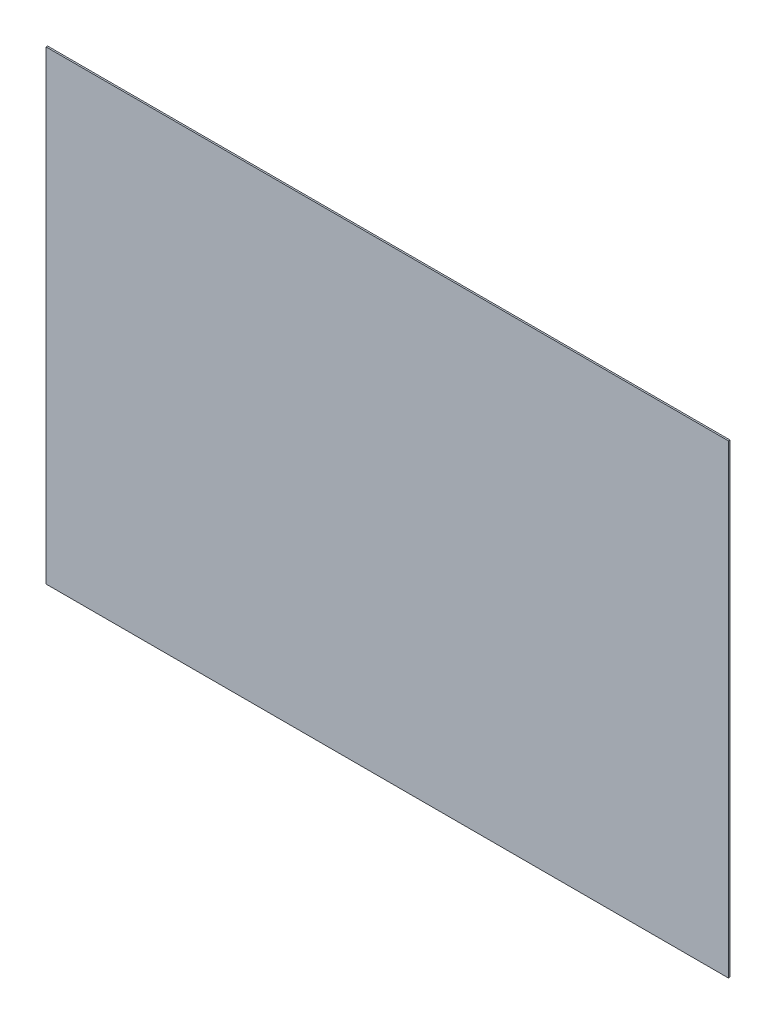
ISO-10303-21;
HEADER;
FILE_DESCRIPTION(('STEP AP214'),'2;1');
FILE_NAME('part.step','',(''),(''),'','','');
FILE_SCHEMA(('AUTOMOTIVE_DESIGN { 1 0 10303 214 1 1 1 1 }'));
ENDSEC;
DATA;
#1=APPLICATION_CONTEXT('core data for automotive mechanical design processes');
#2=APPLICATION_PROTOCOL_DEFINITION('international standard','automotive_design',2000,#1);
#3=PRODUCT_CONTEXT('',#1,'mechanical');
#4=PRODUCT('Part','Part','',(#3));
#5=PRODUCT_RELATED_PRODUCT_CATEGORY('part','',(#4));
#6=PRODUCT_DEFINITION_FORMATION('','',#4);
#7=PRODUCT_DEFINITION_CONTEXT('part definition',#1,'design');
#8=PRODUCT_DEFINITION('design','',#6,#7);
#9=PRODUCT_DEFINITION_SHAPE('','',#8);
#10=(LENGTH_UNIT() NAMED_UNIT(*) SI_UNIT(.MILLI.,.METRE.));
#11=(NAMED_UNIT(*) PLANE_ANGLE_UNIT() SI_UNIT($,.RADIAN.));
#12=(NAMED_UNIT(*) SI_UNIT($,.STERADIAN.) SOLID_ANGLE_UNIT());
#13=UNCERTAINTY_MEASURE_WITH_UNIT(LENGTH_MEASURE(1.E-05),#10,'distance_accuracy_value','');
#14=(GEOMETRIC_REPRESENTATION_CONTEXT(3) GLOBAL_UNCERTAINTY_ASSIGNED_CONTEXT((#13)) GLOBAL_UNIT_ASSIGNED_CONTEXT((#10,
#11,#12)) REPRESENTATION_CONTEXT('',''));
#15=CARTESIAN_POINT('',(0.,0.,0.));
#16=DIRECTION('',(0.,0.,1.));
#17=DIRECTION('',(1.,0.,0.));
#18=AXIS2_PLACEMENT_3D('',#15,#16,#17);
#19=CARTESIAN_POINT('',(-1100.,750.,5.));
#20=DIRECTION('',(1.,0.,0.));
#21=DIRECTION('',(0.,0.,-1.));
#22=AXIS2_PLACEMENT_3D('',#19,#20,#21);
#23=PLANE('',#22);
#24=DIRECTION('',(0.,-1.,0.));
#25=VECTOR('',#24,1.);
#26=CARTESIAN_POINT('',(-1100.,750.,0.));
#27=LINE('',#26,#25);
#28=CARTESIAN_POINT('',(-1100.,750.,0.));
#29=VERTEX_POINT('',#28);
#30=CARTESIAN_POINT('',(-1100.,-750.,0.));
#31=VERTEX_POINT('',#30);
#32=EDGE_CURVE('E72',#29,#31,#27,.T.);
#33=ORIENTED_EDGE('',*,*,#32,.T.);
#34=DIRECTION('',(0.,0.,-1.));
#35=VECTOR('',#34,1.);
#36=CARTESIAN_POINT('',(-1100.,-750.,5.));
#37=LINE('',#36,#35);
#38=CARTESIAN_POINT('',(-1100.,-750.,5.));
#39=VERTEX_POINT('',#38);
#40=EDGE_CURVE('E11',#39,#31,#37,.T.);
#41=ORIENTED_EDGE('',*,*,#40,.F.);
#42=DIRECTION('',(0.,-1.,0.));
#43=VECTOR('',#42,1.);
#44=CARTESIAN_POINT('',(-1100.,750.,5.));
#45=LINE('',#44,#43);
#46=CARTESIAN_POINT('',(-1100.,750.,5.));
#47=VERTEX_POINT('',#46);
#48=EDGE_CURVE('E90',#47,#39,#45,.T.);
#49=ORIENTED_EDGE('',*,*,#48,.F.);
#50=DIRECTION('',(0.,0.,-1.));
#51=VECTOR('',#50,1.);
#52=CARTESIAN_POINT('',(-1100.,750.,5.));
#53=LINE('',#52,#51);
#54=EDGE_CURVE('E84',#47,#29,#53,.T.);
#55=ORIENTED_EDGE('',*,*,#54,.T.);
#56=EDGE_LOOP('',(#33,#41,#49,#55));
#57=FACE_BOUND('',#56,.T.);
#58=ADVANCED_FACE('F28',(#57),#23,.F.);
#59=CARTESIAN_POINT('',(-1100.,-750.,5.));
#60=DIRECTION('',(0.,1.,0.));
#61=DIRECTION('',(-1.,0.,0.));
#62=AXIS2_PLACEMENT_3D('',#59,#60,#61);
#63=PLANE('',#62);
#64=DIRECTION('',(1.,0.,0.));
#65=VECTOR('',#64,1.);
#66=CARTESIAN_POINT('',(-1100.,-750.,0.));
#67=LINE('',#66,#65);
#68=CARTESIAN_POINT('',(1100.,-750.000000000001,0.));
#69=VERTEX_POINT('',#68);
#70=EDGE_CURVE('E68',#31,#69,#67,.T.);
#71=ORIENTED_EDGE('',*,*,#70,.T.);
#72=DIRECTION('',(0.,0.,-1.));
#73=VECTOR('',#72,1.);
#74=CARTESIAN_POINT('',(1100.,-750.000000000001,5.));
#75=LINE('',#74,#73);
#76=CARTESIAN_POINT('',(1100.,-750.000000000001,5.));
#77=VERTEX_POINT('',#76);
#78=EDGE_CURVE('E35',#77,#69,#75,.T.);
#79=ORIENTED_EDGE('',*,*,#78,.F.);
#80=DIRECTION('',(1.,0.,0.));
#81=VECTOR('',#80,1.);
#82=CARTESIAN_POINT('',(-1100.,-750.,5.));
#83=LINE('',#82,#81);
#84=EDGE_CURVE('E80',#39,#77,#83,.T.);
#85=ORIENTED_EDGE('',*,*,#84,.F.);
#86=ORIENTED_EDGE('',*,*,#40,.T.);
#87=EDGE_LOOP('',(#71,#79,#85,#86));
#88=FACE_BOUND('',#87,.T.);
#89=ADVANCED_FACE('F79',(#88),#63,.F.);
#90=CARTESIAN_POINT('',(1100.,750.000000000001,5.));
#91=DIRECTION('',(-1.,0.,0.));
#92=DIRECTION('',(0.,0.,1.));
#93=AXIS2_PLACEMENT_3D('',#90,#91,#92);
#94=PLANE('',#93);
#95=DIRECTION('',(0.,1.,0.));
#96=VECTOR('',#95,1.);
#97=CARTESIAN_POINT('',(1100.,750.000000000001,0.));
#98=LINE('',#97,#96);
#99=CARTESIAN_POINT('',(1100.,750.000000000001,0.));
#100=VERTEX_POINT('',#99);
#101=EDGE_CURVE('E73',#69,#100,#98,.T.);
#102=ORIENTED_EDGE('',*,*,#101,.T.);
#103=DIRECTION('',(0.,0.,-1.));
#104=VECTOR('',#103,1.);
#105=CARTESIAN_POINT('',(1100.,750.000000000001,5.));
#106=LINE('',#105,#104);
#107=CARTESIAN_POINT('',(1100.,750.000000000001,5.));
#108=VERTEX_POINT('',#107);
#109=EDGE_CURVE('E96',#108,#100,#106,.T.);
#110=ORIENTED_EDGE('',*,*,#109,.F.);
#111=DIRECTION('',(0.,1.,0.));
#112=VECTOR('',#111,1.);
#113=CARTESIAN_POINT('',(1100.,750.000000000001,5.));
#114=LINE('',#113,#112);
#115=EDGE_CURVE('E47',#77,#108,#114,.T.);
#116=ORIENTED_EDGE('',*,*,#115,.F.);
#117=ORIENTED_EDGE('',*,*,#78,.T.);
#118=EDGE_LOOP('',(#102,#110,#116,#117));
#119=FACE_BOUND('',#118,.T.);
#120=ADVANCED_FACE('F99',(#119),#94,.F.);
#121=CARTESIAN_POINT('',(-1100.,750.,5.));
#122=DIRECTION('',(0.,-1.,0.));
#123=DIRECTION('',(1.,0.,0.));
#124=AXIS2_PLACEMENT_3D('',#121,#122,#123);
#125=PLANE('',#124);
#126=DIRECTION('',(-1.,0.,0.));
#127=VECTOR('',#126,1.);
#128=CARTESIAN_POINT('',(-1100.,750.,0.));
#129=LINE('',#128,#127);
#130=EDGE_CURVE('E88',#100,#29,#129,.T.);
#131=ORIENTED_EDGE('',*,*,#130,.T.);
#132=ORIENTED_EDGE('',*,*,#54,.F.);
#133=DIRECTION('',(-1.,0.,0.));
#134=VECTOR('',#133,1.);
#135=CARTESIAN_POINT('',(-1100.,750.,5.));
#136=LINE('',#135,#134);
#137=EDGE_CURVE('E42',#108,#47,#136,.T.);
#138=ORIENTED_EDGE('',*,*,#137,.F.);
#139=ORIENTED_EDGE('',*,*,#109,.T.);
#140=EDGE_LOOP('',(#131,#132,#138,#139));
#141=FACE_BOUND('',#140,.T.);
#142=ADVANCED_FACE('F101',(#141),#125,.F.);
#143=CARTESIAN_POINT('',(-1100.,750.,5.));
#144=DIRECTION('',(0.,0.,1.));
#145=DIRECTION('',(1.,0.,0.));
#146=AXIS2_PLACEMENT_3D('',#143,#144,#145);
#147=PLANE('',#146);
#148=ORIENTED_EDGE('',*,*,#48,.T.);
#149=ORIENTED_EDGE('',*,*,#84,.T.);
#150=ORIENTED_EDGE('',*,*,#115,.T.);
#151=ORIENTED_EDGE('',*,*,#137,.T.);
#152=EDGE_LOOP('',(#148,#149,#150,#151));
#153=FACE_BOUND('',#152,.T.);
#154=ADVANCED_FACE('F102',(#153),#147,.T.);
#155=CARTESIAN_POINT('',(-1100.,750.,0.));
#156=DIRECTION('',(0.,0.,1.));
#157=DIRECTION('',(1.,0.,0.));
#158=AXIS2_PLACEMENT_3D('',#155,#156,#157);
#159=PLANE('',#158);
#160=ORIENTED_EDGE('',*,*,#32,.F.);
#161=ORIENTED_EDGE('',*,*,#130,.F.);
#162=ORIENTED_EDGE('',*,*,#101,.F.);
#163=ORIENTED_EDGE('',*,*,#70,.F.);
#164=EDGE_LOOP('',(#160,#161,#162,#163));
#165=FACE_BOUND('',#164,.T.);
#166=ADVANCED_FACE('F69',(#165),#159,.F.);
#167=CLOSED_SHELL('',(#58,#89,#120,#142,#154,#166));
#168=MANIFOLD_SOLID_BREP('B2',#167);
#169=ADVANCED_BREP_SHAPE_REPRESENTATION('',(#18,#168),#14);
#170=SHAPE_DEFINITION_REPRESENTATION(#9,#169);
ENDSEC;
END-ISO-10303-21;
